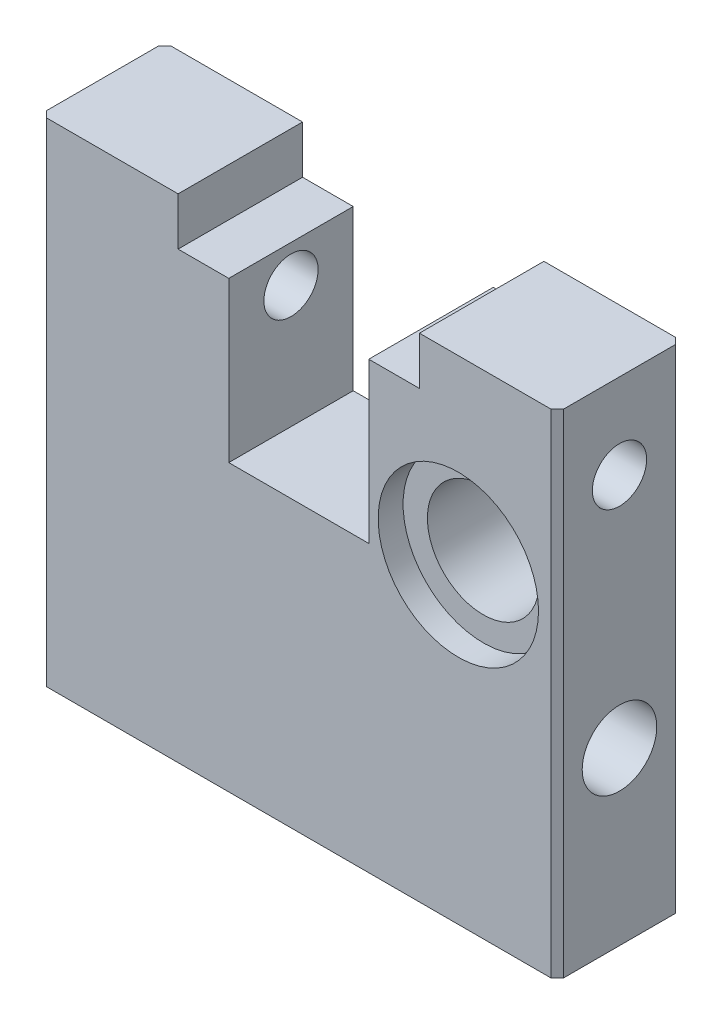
ISO-10303-21;
HEADER;
FILE_DESCRIPTION(('STEP AP214'),'2;1');
FILE_NAME('part.step','',(''),(''),'','','');
FILE_SCHEMA(('AUTOMOTIVE_DESIGN { 1 0 10303 214 1 1 1 1 }'));
ENDSEC;
DATA;
#1=APPLICATION_CONTEXT('core data for automotive mechanical design processes');
#2=APPLICATION_PROTOCOL_DEFINITION('international standard','automotive_design',2000,#1);
#3=PRODUCT_CONTEXT('',#1,'mechanical');
#4=PRODUCT('Part','Part','',(#3));
#5=PRODUCT_RELATED_PRODUCT_CATEGORY('part','',(#4));
#6=PRODUCT_DEFINITION_FORMATION('','',#4);
#7=PRODUCT_DEFINITION_CONTEXT('part definition',#1,'design');
#8=PRODUCT_DEFINITION('design','',#6,#7);
#9=PRODUCT_DEFINITION_SHAPE('','',#8);
#10=(LENGTH_UNIT() NAMED_UNIT(*) SI_UNIT(.MILLI.,.METRE.));
#11=(NAMED_UNIT(*) PLANE_ANGLE_UNIT() SI_UNIT($,.RADIAN.));
#12=(NAMED_UNIT(*) SI_UNIT($,.STERADIAN.) SOLID_ANGLE_UNIT());
#13=UNCERTAINTY_MEASURE_WITH_UNIT(LENGTH_MEASURE(1.E-05),#10,'distance_accuracy_value','');
#14=(GEOMETRIC_REPRESENTATION_CONTEXT(3) GLOBAL_UNCERTAINTY_ASSIGNED_CONTEXT((#13)) GLOBAL_UNIT_ASSIGNED_CONTEXT((#10,
#11,#12)) REPRESENTATION_CONTEXT('',''));
#15=CARTESIAN_POINT('',(0.,0.,0.));
#16=DIRECTION('',(0.,0.,1.));
#17=DIRECTION('',(1.,0.,0.));
#18=AXIS2_PLACEMENT_3D('',#15,#16,#17);
#19=CARTESIAN_POINT('',(16.4592,25.9588,3.9624));
#20=DIRECTION('',(-1.,0.,0.));
#21=DIRECTION('',(0.,0.,1.));
#22=AXIS2_PLACEMENT_3D('',#19,#20,#21);
#23=CYLINDRICAL_SURFACE('',#22,1.7272);
#24=CARTESIAN_POINT('',(-4.4577,25.9588,3.9624));
#25=DIRECTION('',(-1.,0.,0.));
#26=DIRECTION('',(0.,-1.,0.));
#27=AXIS2_PLACEMENT_3D('',#24,#25,#26);
#28=CIRCLE('',#27,1.7272);
#29=CARTESIAN_POINT('',(-4.4577,24.2316,3.9624));
#30=VERTEX_POINT('',#29);
#31=EDGE_CURVE('E246',#30,#30,#28,.T.);
#32=ORIENTED_EDGE('',*,*,#31,.F.);
#33=EDGE_LOOP('',(#32));
#34=FACE_BOUND('',#33,.T.);
#35=CARTESIAN_POINT('',(-9.31545,25.9588,3.9624));
#36=DIRECTION('',(-1.,0.,0.));
#37=DIRECTION('',(0.,0.,1.));
#38=AXIS2_PLACEMENT_3D('',#35,#36,#37);
#39=CIRCLE('',#38,1.7272);
#40=CARTESIAN_POINT('',(-9.31545,25.9588,5.6896));
#41=VERTEX_POINT('',#40);
#42=EDGE_CURVE('E251',#41,#41,#39,.F.);
#43=ORIENTED_EDGE('',*,*,#42,.F.);
#44=EDGE_LOOP('',(#43));
#45=FACE_BOUND('',#44,.T.);
#46=ADVANCED_FACE('F35',(#34,#45),#23,.F.);
#47=CARTESIAN_POINT('',(10.16,19.83994,7.9248));
#48=DIRECTION('',(0.,0.,-1.));
#49=DIRECTION('',(-1.,0.,0.));
#50=AXIS2_PLACEMENT_3D('',#47,#48,#49);
#51=CYLINDRICAL_SURFACE('',#50,3.556);
#52=CARTESIAN_POINT('',(10.16,19.83994,0.));
#53=DIRECTION('',(0.,0.,1.));
#54=DIRECTION('',(1.,0.,0.));
#55=AXIS2_PLACEMENT_3D('',#52,#53,#54);
#56=CIRCLE('',#55,3.556);
#57=CARTESIAN_POINT('',(13.716,19.83994,0.));
#58=VERTEX_POINT('',#57);
#59=EDGE_CURVE('E196',#58,#58,#56,.T.);
#60=ORIENTED_EDGE('',*,*,#59,.F.);
#61=EDGE_LOOP('',(#60));
#62=FACE_BOUND('',#61,.T.);
#63=CARTESIAN_POINT('',(10.16,19.83994,6.3373));
#64=DIRECTION('',(0.,0.,1.));
#65=DIRECTION('',(1.,0.,0.));
#66=AXIS2_PLACEMENT_3D('',#63,#64,#65);
#67=CIRCLE('',#66,3.556);
#68=CARTESIAN_POINT('',(13.716,19.83994,6.3373));
#69=VERTEX_POINT('',#68);
#70=EDGE_CURVE('E242',#69,#69,#67,.T.);
#71=ORIENTED_EDGE('',*,*,#70,.T.);
#72=EDGE_LOOP('',(#71));
#73=FACE_BOUND('',#72,.T.);
#74=ADVANCED_FACE('F368',(#62,#73),#51,.F.);
#75=CARTESIAN_POINT('',(0.,0.,7.9248));
#76=DIRECTION('',(0.,0.,-1.));
#77=DIRECTION('',(-1.,0.,0.));
#78=AXIS2_PLACEMENT_3D('',#75,#76,#77);
#79=PLANE('',#78);
#80=CARTESIAN_POINT('',(10.16,19.83994,7.9248));
#81=DIRECTION('',(0.,0.,1.));
#82=DIRECTION('',(1.,0.,0.));
#83=AXIS2_PLACEMENT_3D('',#80,#81,#82);
#84=CIRCLE('',#83,5.1054);
#85=CARTESIAN_POINT('',(15.2654,19.83994,7.9248));
#86=VERTEX_POINT('',#85);
#87=EDGE_CURVE('E319',#86,#86,#84,.T.);
#88=ORIENTED_EDGE('',*,*,#87,.F.);
#89=EDGE_LOOP('',(#88));
#90=FACE_BOUND('',#89,.T.);
#91=DIRECTION('',(1.,0.,0.));
#92=VECTOR('',#91,1.);
#93=CARTESIAN_POINT('',(-16.4592,0.,7.9248));
#94=LINE('',#93,#92);
#95=CARTESIAN_POINT('',(-16.062325,0.,7.9248));
#96=VERTEX_POINT('',#95);
#97=CARTESIAN_POINT('',(16.062325,0.,7.9248));
#98=VERTEX_POINT('',#97);
#99=EDGE_CURVE('E158',#96,#98,#94,.T.);
#100=ORIENTED_EDGE('',*,*,#99,.T.);
#101=DIRECTION('',(0.,1.,0.));
#102=VECTOR('',#101,1.);
#103=CARTESIAN_POINT('',(16.062325,0.,7.9248));
#104=LINE('',#103,#102);
#105=CARTESIAN_POINT('',(16.062325,31.369,7.9248));
#106=VERTEX_POINT('',#105);
#107=EDGE_CURVE('E156',#98,#106,#104,.T.);
#108=ORIENTED_EDGE('',*,*,#107,.T.);
#109=DIRECTION('',(-1.,0.,0.));
#110=VECTOR('',#109,1.);
#111=CARTESIAN_POINT('',(7.6835,31.369,7.9248));
#112=LINE('',#111,#110);
#113=CARTESIAN_POINT('',(7.6835,31.369,7.9248));
#114=VERTEX_POINT('',#113);
#115=EDGE_CURVE('E148',#106,#114,#112,.T.);
#116=ORIENTED_EDGE('',*,*,#115,.T.);
#117=DIRECTION('',(0.,-1.,0.));
#118=VECTOR('',#117,1.);
#119=CARTESIAN_POINT('',(7.6835,31.369,7.9248));
#120=LINE('',#119,#118);
#121=CARTESIAN_POINT('',(7.6835,28.321,7.9248));
#122=VERTEX_POINT('',#121);
#123=EDGE_CURVE('E153',#114,#122,#120,.T.);
#124=ORIENTED_EDGE('',*,*,#123,.T.);
#125=DIRECTION('',(-1.,0.,0.));
#126=VECTOR('',#125,1.);
#127=CARTESIAN_POINT('',(7.6835,28.321,7.9248));
#128=LINE('',#127,#126);
#129=CARTESIAN_POINT('',(4.4577,28.321,7.9248));
#130=VERTEX_POINT('',#129);
#131=EDGE_CURVE('E174',#122,#130,#128,.T.);
#132=ORIENTED_EDGE('',*,*,#131,.T.);
#133=DIRECTION('',(0.,-1.,0.));
#134=VECTOR('',#133,1.);
#135=CARTESIAN_POINT('',(4.4577,28.321,7.9248));
#136=LINE('',#135,#134);
#137=CARTESIAN_POINT('',(4.4577,18.161,7.9248));
#138=VERTEX_POINT('',#137);
#139=EDGE_CURVE('E176',#130,#138,#136,.T.);
#140=ORIENTED_EDGE('',*,*,#139,.T.);
#141=DIRECTION('',(-1.,0.,0.));
#142=VECTOR('',#141,1.);
#143=CARTESIAN_POINT('',(4.4577,18.161,7.9248));
#144=LINE('',#143,#142);
#145=CARTESIAN_POINT('',(-4.4577,18.161,7.9248));
#146=VERTEX_POINT('',#145);
#147=EDGE_CURVE('E181',#138,#146,#144,.T.);
#148=ORIENTED_EDGE('',*,*,#147,.T.);
#149=DIRECTION('',(0.,1.,0.));
#150=VECTOR('',#149,1.);
#151=CARTESIAN_POINT('',(-4.4577,28.321,7.9248));
#152=LINE('',#151,#150);
#153=CARTESIAN_POINT('',(-4.4577,28.321,7.9248));
#154=VERTEX_POINT('',#153);
#155=EDGE_CURVE('E183',#146,#154,#152,.T.);
#156=ORIENTED_EDGE('',*,*,#155,.T.);
#157=DIRECTION('',(-1.,0.,0.));
#158=VECTOR('',#157,1.);
#159=CARTESIAN_POINT('',(-4.4577,28.321,7.9248));
#160=LINE('',#159,#158);
#161=CARTESIAN_POINT('',(-7.6835,28.321,7.9248));
#162=VERTEX_POINT('',#161);
#163=EDGE_CURVE('E185',#154,#162,#160,.T.);
#164=ORIENTED_EDGE('',*,*,#163,.T.);
#165=DIRECTION('',(0.,1.,0.));
#166=VECTOR('',#165,1.);
#167=CARTESIAN_POINT('',(-7.6835,31.369,7.9248));
#168=LINE('',#167,#166);
#169=CARTESIAN_POINT('',(-7.6835,31.369,7.9248));
#170=VERTEX_POINT('',#169);
#171=EDGE_CURVE('E187',#162,#170,#168,.T.);
#172=ORIENTED_EDGE('',*,*,#171,.T.);
#173=DIRECTION('',(-1.,0.,0.));
#174=VECTOR('',#173,1.);
#175=CARTESIAN_POINT('',(-16.4592,31.369,7.9248));
#176=LINE('',#175,#174);
#177=CARTESIAN_POINT('',(-16.062325,31.369,7.9248));
#178=VERTEX_POINT('',#177);
#179=EDGE_CURVE('E189',#170,#178,#176,.T.);
#180=ORIENTED_EDGE('',*,*,#179,.T.);
#181=DIRECTION('',(0.,-1.,0.));
#182=VECTOR('',#181,1.);
#183=CARTESIAN_POINT('',(-16.062325,0.,7.9248));
#184=LINE('',#183,#182);
#185=EDGE_CURVE('E276',#178,#96,#184,.T.);
#186=ORIENTED_EDGE('',*,*,#185,.T.);
#187=EDGE_LOOP('',(#100,#108,#116,#124,#132,#140,#148,#156,#164,#172,#180,#186));
#188=FACE_BOUND('',#187,.T.);
#189=ADVANCED_FACE('F151',(#90,#188),#79,.F.);
#190=CARTESIAN_POINT('',(0.,0.,0.));
#191=DIRECTION('',(0.,0.,-1.));
#192=DIRECTION('',(-1.,0.,0.));
#193=AXIS2_PLACEMENT_3D('',#190,#191,#192);
#194=PLANE('',#193);
#195=DIRECTION('',(-1.,0.,0.));
#196=VECTOR('',#195,1.);
#197=CARTESIAN_POINT('',(7.6835,31.369,0.));
#198=LINE('',#197,#196);
#199=CARTESIAN_POINT('',(16.062325,31.369,0.));
#200=VERTEX_POINT('',#199);
#201=CARTESIAN_POINT('',(7.6835,31.369,0.));
#202=VERTEX_POINT('',#201);
#203=EDGE_CURVE('E165',#200,#202,#198,.T.);
#204=ORIENTED_EDGE('',*,*,#203,.F.);
#205=DIRECTION('',(0.,-1.,0.));
#206=VECTOR('',#205,1.);
#207=CARTESIAN_POINT('',(16.062325,0.,0.));
#208=LINE('',#207,#206);
#209=CARTESIAN_POINT('',(16.062325,0.,0.));
#210=VERTEX_POINT('',#209);
#211=EDGE_CURVE('E266',#200,#210,#208,.T.);
#212=ORIENTED_EDGE('',*,*,#211,.T.);
#213=DIRECTION('',(1.,0.,0.));
#214=VECTOR('',#213,1.);
#215=CARTESIAN_POINT('',(-16.4592,0.,0.));
#216=LINE('',#215,#214);
#217=CARTESIAN_POINT('',(-16.062325,0.,0.));
#218=VERTEX_POINT('',#217);
#219=EDGE_CURVE('E193',#218,#210,#216,.T.);
#220=ORIENTED_EDGE('',*,*,#219,.F.);
#221=DIRECTION('',(0.,1.,0.));
#222=VECTOR('',#221,1.);
#223=CARTESIAN_POINT('',(-16.062325,31.369,0.));
#224=LINE('',#223,#222);
#225=CARTESIAN_POINT('',(-16.062325,31.369,0.));
#226=VERTEX_POINT('',#225);
#227=EDGE_CURVE('E264',#218,#226,#224,.T.);
#228=ORIENTED_EDGE('',*,*,#227,.T.);
#229=DIRECTION('',(-1.,0.,0.));
#230=VECTOR('',#229,1.);
#231=CARTESIAN_POINT('',(-16.4592,31.369,0.));
#232=LINE('',#231,#230);
#233=CARTESIAN_POINT('',(-7.6835,31.369,0.));
#234=VERTEX_POINT('',#233);
#235=EDGE_CURVE('E212',#234,#226,#232,.T.);
#236=ORIENTED_EDGE('',*,*,#235,.F.);
#237=DIRECTION('',(0.,1.,0.));
#238=VECTOR('',#237,1.);
#239=CARTESIAN_POINT('',(-7.6835,31.369,0.));
#240=LINE('',#239,#238);
#241=CARTESIAN_POINT('',(-7.6835,28.321,0.));
#242=VERTEX_POINT('',#241);
#243=EDGE_CURVE('E210',#242,#234,#240,.T.);
#244=ORIENTED_EDGE('',*,*,#243,.F.);
#245=DIRECTION('',(-1.,0.,0.));
#246=VECTOR('',#245,1.);
#247=CARTESIAN_POINT('',(-4.4577,28.321,0.));
#248=LINE('',#247,#246);
#249=CARTESIAN_POINT('',(-4.4577,28.321,0.));
#250=VERTEX_POINT('',#249);
#251=EDGE_CURVE('E208',#250,#242,#248,.T.);
#252=ORIENTED_EDGE('',*,*,#251,.F.);
#253=DIRECTION('',(0.,1.,0.));
#254=VECTOR('',#253,1.);
#255=CARTESIAN_POINT('',(-4.4577,28.321,0.));
#256=LINE('',#255,#254);
#257=CARTESIAN_POINT('',(-4.4577,18.161,0.));
#258=VERTEX_POINT('',#257);
#259=EDGE_CURVE('E206',#258,#250,#256,.T.);
#260=ORIENTED_EDGE('',*,*,#259,.F.);
#261=DIRECTION('',(-1.,0.,0.));
#262=VECTOR('',#261,1.);
#263=CARTESIAN_POINT('',(4.4577,18.161,0.));
#264=LINE('',#263,#262);
#265=CARTESIAN_POINT('',(4.4577,18.161,0.));
#266=VERTEX_POINT('',#265);
#267=EDGE_CURVE('E204',#266,#258,#264,.T.);
#268=ORIENTED_EDGE('',*,*,#267,.F.);
#269=DIRECTION('',(0.,-1.,0.));
#270=VECTOR('',#269,1.);
#271=CARTESIAN_POINT('',(4.4577,28.321,0.));
#272=LINE('',#271,#270);
#273=CARTESIAN_POINT('',(4.4577,28.321,0.));
#274=VERTEX_POINT('',#273);
#275=EDGE_CURVE('E202',#274,#266,#272,.T.);
#276=ORIENTED_EDGE('',*,*,#275,.F.);
#277=DIRECTION('',(-1.,0.,0.));
#278=VECTOR('',#277,1.);
#279=CARTESIAN_POINT('',(7.6835,28.321,0.));
#280=LINE('',#279,#278);
#281=CARTESIAN_POINT('',(7.6835,28.321,0.));
#282=VERTEX_POINT('',#281);
#283=EDGE_CURVE('E200',#282,#274,#280,.T.);
#284=ORIENTED_EDGE('',*,*,#283,.F.);
#285=DIRECTION('',(0.,-1.,0.));
#286=VECTOR('',#285,1.);
#287=CARTESIAN_POINT('',(7.6835,31.369,0.));
#288=LINE('',#287,#286);
#289=EDGE_CURVE('E198',#202,#282,#288,.T.);
#290=ORIENTED_EDGE('',*,*,#289,.F.);
#291=EDGE_LOOP('',(#204,#212,#220,#228,#236,#244,#252,#260,#268,#276,#284,#290));
#292=FACE_BOUND('',#291,.T.);
#293=ORIENTED_EDGE('',*,*,#59,.T.);
#294=EDGE_LOOP('',(#293));
#295=FACE_BOUND('',#294,.T.);
#296=ADVANCED_FACE('F301',(#292,#295),#194,.T.);
#297=CARTESIAN_POINT('',(-16.4592,0.,7.9248));
#298=DIRECTION('',(1.,0.,0.));
#299=DIRECTION('',(0.,0.,-1.));
#300=AXIS2_PLACEMENT_3D('',#297,#298,#299);
#301=PLANE('',#300);
#302=CARTESIAN_POINT('',(-16.4592,25.9588,3.9624));
#303=DIRECTION('',(-1.,0.,0.));
#304=DIRECTION('',(0.,0.,1.));
#305=AXIS2_PLACEMENT_3D('',#302,#303,#304);
#306=CIRCLE('',#305,3.2004);
#307=CARTESIAN_POINT('',(-16.4592,25.9588,7.1628));
#308=VERTEX_POINT('',#307);
#309=EDGE_CURVE('E333',#308,#308,#306,.T.);
#310=ORIENTED_EDGE('',*,*,#309,.F.);
#311=EDGE_LOOP('',(#310));
#312=FACE_BOUND('',#311,.T.);
#313=CARTESIAN_POINT('',(-16.4592,10.8966,3.9624));
#314=DIRECTION('',(-1.,0.,0.));
#315=DIRECTION('',(0.,0.,1.));
#316=AXIS2_PLACEMENT_3D('',#313,#314,#315);
#317=CIRCLE('',#316,2.3749);
#318=CARTESIAN_POINT('',(-16.4592,10.8966,6.3373));
#319=VERTEX_POINT('',#318);
#320=EDGE_CURVE('E254',#319,#319,#317,.T.);
#321=ORIENTED_EDGE('',*,*,#320,.F.);
#322=EDGE_LOOP('',(#321));
#323=FACE_BOUND('',#322,.T.);
#324=DIRECTION('',(0.,0.,-1.));
#325=VECTOR('',#324,1.);
#326=CARTESIAN_POINT('',(-16.4592,31.369,7.9248));
#327=LINE('',#326,#325);
#328=CARTESIAN_POINT('',(-16.4592,31.369,7.527925));
#329=VERTEX_POINT('',#328);
#330=CARTESIAN_POINT('',(-16.4592,31.369,0.396875));
#331=VERTEX_POINT('',#330);
#332=EDGE_CURVE('E192',#329,#331,#327,.T.);
#333=ORIENTED_EDGE('',*,*,#332,.T.);
#334=DIRECTION('',(0.,-1.,0.));
#335=VECTOR('',#334,1.);
#336=CARTESIAN_POINT('',(-16.4592,0.,0.396874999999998));
#337=LINE('',#336,#335);
#338=CARTESIAN_POINT('',(-16.4592,0.,0.396875));
#339=VERTEX_POINT('',#338);
#340=EDGE_CURVE('E281',#331,#339,#337,.T.);
#341=ORIENTED_EDGE('',*,*,#340,.T.);
#342=DIRECTION('',(0.,0.,-1.));
#343=VECTOR('',#342,1.);
#344=CARTESIAN_POINT('',(-16.4592,0.,7.9248));
#345=LINE('',#344,#343);
#346=CARTESIAN_POINT('',(-16.4592,0.,7.527925));
#347=VERTEX_POINT('',#346);
#348=EDGE_CURVE('E238',#347,#339,#345,.T.);
#349=ORIENTED_EDGE('',*,*,#348,.F.);
#350=DIRECTION('',(0.,1.,0.));
#351=VECTOR('',#350,1.);
#352=CARTESIAN_POINT('',(-16.4592,0.,7.527925));
#353=LINE('',#352,#351);
#354=EDGE_CURVE('E55',#347,#329,#353,.T.);
#355=ORIENTED_EDGE('',*,*,#354,.T.);
#356=EDGE_LOOP('',(#333,#341,#349,#355));
#357=FACE_BOUND('',#356,.T.);
#358=ADVANCED_FACE('F293',(#312,#323,#357),#301,.F.);
#359=CARTESIAN_POINT('',(-16.4592,0.,7.9248));
#360=DIRECTION('',(0.,1.,0.));
#361=DIRECTION('',(0.,0.,1.));
#362=AXIS2_PLACEMENT_3D('',#359,#360,#361);
#363=PLANE('',#362);
#364=ORIENTED_EDGE('',*,*,#219,.T.);
#365=DIRECTION('',(0.707106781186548,0.,0.707106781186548));
#366=VECTOR('',#365,1.);
#367=CARTESIAN_POINT('',(16.4592,0.,0.396874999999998));
#368=LINE('',#367,#366);
#369=CARTESIAN_POINT('',(16.4592,0.,0.396875));
#370=VERTEX_POINT('',#369);
#371=EDGE_CURVE('E274',#210,#370,#368,.T.);
#372=ORIENTED_EDGE('',*,*,#371,.T.);
#373=DIRECTION('',(0.,0.,-1.));
#374=VECTOR('',#373,1.);
#375=CARTESIAN_POINT('',(16.4592,0.,7.9248));
#376=LINE('',#375,#374);
#377=CARTESIAN_POINT('',(16.4592,0.,7.527925));
#378=VERTEX_POINT('',#377);
#379=EDGE_CURVE('E235',#378,#370,#376,.T.);
#380=ORIENTED_EDGE('',*,*,#379,.F.);
#381=DIRECTION('',(0.707106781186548,0.,-0.707106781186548));
#382=VECTOR('',#381,1.);
#383=CARTESIAN_POINT('',(16.062325,0.,7.9248));
#384=LINE('',#383,#382);
#385=EDGE_CURVE('E272',#378,#98,#384,.F.);
#386=ORIENTED_EDGE('',*,*,#385,.T.);
#387=ORIENTED_EDGE('',*,*,#99,.F.);
#388=DIRECTION('',(0.707106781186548,0.,0.707106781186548));
#389=VECTOR('',#388,1.);
#390=CARTESIAN_POINT('',(-16.062325,0.,7.9248));
#391=LINE('',#390,#389);
#392=EDGE_CURVE('E268',#96,#347,#391,.F.);
#393=ORIENTED_EDGE('',*,*,#392,.T.);
#394=ORIENTED_EDGE('',*,*,#348,.T.);
#395=DIRECTION('',(0.707106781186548,0.,-0.707106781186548));
#396=VECTOR('',#395,1.);
#397=CARTESIAN_POINT('',(-16.4592,0.,0.396874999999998));
#398=LINE('',#397,#396);
#399=EDGE_CURVE('E270',#339,#218,#398,.T.);
#400=ORIENTED_EDGE('',*,*,#399,.T.);
#401=EDGE_LOOP('',(#364,#372,#380,#386,#387,#393,#394,#400));
#402=FACE_BOUND('',#401,.T.);
#403=ADVANCED_FACE('F292',(#402),#363,.F.);
#404=CARTESIAN_POINT('',(16.4592,0.,7.9248));
#405=DIRECTION('',(-1.,0.,0.));
#406=DIRECTION('',(0.,0.,1.));
#407=AXIS2_PLACEMENT_3D('',#404,#405,#406);
#408=PLANE('',#407);
#409=CARTESIAN_POINT('',(16.4592,10.8966,3.9624));
#410=DIRECTION('',(-1.,0.,0.));
#411=DIRECTION('',(0.,0.,1.));
#412=AXIS2_PLACEMENT_3D('',#409,#410,#411);
#413=CIRCLE('',#412,2.3749);
#414=CARTESIAN_POINT('',(16.4592,10.8966,6.3373));
#415=VERTEX_POINT('',#414);
#416=EDGE_CURVE('E328',#415,#415,#413,.T.);
#417=ORIENTED_EDGE('',*,*,#416,.T.);
#418=EDGE_LOOP('',(#417));
#419=FACE_BOUND('',#418,.T.);
#420=CARTESIAN_POINT('',(16.4592,25.9588,3.9624));
#421=DIRECTION('',(-1.,0.,0.));
#422=DIRECTION('',(0.,0.,1.));
#423=AXIS2_PLACEMENT_3D('',#420,#421,#422);
#424=CIRCLE('',#423,1.7272);
#425=CARTESIAN_POINT('',(16.4592,25.9588,5.6896));
#426=VERTEX_POINT('',#425);
#427=EDGE_CURVE('E250',#426,#426,#424,.T.);
#428=ORIENTED_EDGE('',*,*,#427,.T.);
#429=EDGE_LOOP('',(#428));
#430=FACE_BOUND('',#429,.T.);
#431=ORIENTED_EDGE('',*,*,#379,.T.);
#432=DIRECTION('',(0.,1.,0.));
#433=VECTOR('',#432,1.);
#434=CARTESIAN_POINT('',(16.4592,31.369,0.396874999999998));
#435=LINE('',#434,#433);
#436=CARTESIAN_POINT('',(16.4592,31.369,0.396875));
#437=VERTEX_POINT('',#436);
#438=EDGE_CURVE('E257',#370,#437,#435,.T.);
#439=ORIENTED_EDGE('',*,*,#438,.T.);
#440=DIRECTION('',(0.,0.,-1.));
#441=VECTOR('',#440,1.);
#442=CARTESIAN_POINT('',(16.4592,31.369,7.9248));
#443=LINE('',#442,#441);
#444=CARTESIAN_POINT('',(16.4592,31.369,7.527925));
#445=VERTEX_POINT('',#444);
#446=EDGE_CURVE('E168',#445,#437,#443,.T.);
#447=ORIENTED_EDGE('',*,*,#446,.F.);
#448=DIRECTION('',(0.,-1.,0.));
#449=VECTOR('',#448,1.);
#450=CARTESIAN_POINT('',(16.4592,0.,7.527925));
#451=LINE('',#450,#449);
#452=EDGE_CURVE('E241',#445,#378,#451,.T.);
#453=ORIENTED_EDGE('',*,*,#452,.T.);
#454=EDGE_LOOP('',(#431,#439,#447,#453));
#455=FACE_BOUND('',#454,.T.);
#456=ADVANCED_FACE('F311',(#419,#430,#455),#408,.F.);
#457=CARTESIAN_POINT('',(7.6835,31.369,7.9248));
#458=DIRECTION('',(0.,-1.,0.));
#459=DIRECTION('',(0.,0.,-1.));
#460=AXIS2_PLACEMENT_3D('',#457,#458,#459);
#461=PLANE('',#460);
#462=ORIENTED_EDGE('',*,*,#446,.T.);
#463=DIRECTION('',(-0.707106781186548,0.,-0.707106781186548));
#464=VECTOR('',#463,1.);
#465=CARTESIAN_POINT('',(16.4592,31.369,0.396874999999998));
#466=LINE('',#465,#464);
#467=EDGE_CURVE('E262',#437,#200,#466,.T.);
#468=ORIENTED_EDGE('',*,*,#467,.T.);
#469=ORIENTED_EDGE('',*,*,#203,.T.);
#470=DIRECTION('',(0.,0.,-1.));
#471=VECTOR('',#470,1.);
#472=CARTESIAN_POINT('',(7.6835,31.369,7.9248));
#473=LINE('',#472,#471);
#474=EDGE_CURVE('E161',#114,#202,#473,.T.);
#475=ORIENTED_EDGE('',*,*,#474,.F.);
#476=ORIENTED_EDGE('',*,*,#115,.F.);
#477=DIRECTION('',(-0.707106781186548,0.,0.707106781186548));
#478=VECTOR('',#477,1.);
#479=CARTESIAN_POINT('',(16.062325,31.369,7.9248));
#480=LINE('',#479,#478);
#481=EDGE_CURVE('E260',#106,#445,#480,.F.);
#482=ORIENTED_EDGE('',*,*,#481,.T.);
#483=EDGE_LOOP('',(#462,#468,#469,#475,#476,#482));
#484=FACE_BOUND('',#483,.T.);
#485=ADVANCED_FACE('F163',(#484),#461,.F.);
#486=CARTESIAN_POINT('',(7.6835,31.369,7.9248));
#487=DIRECTION('',(1.,0.,0.));
#488=DIRECTION('',(0.,0.,-1.));
#489=AXIS2_PLACEMENT_3D('',#486,#487,#488);
#490=PLANE('',#489);
#491=ORIENTED_EDGE('',*,*,#289,.T.);
#492=DIRECTION('',(0.,0.,-1.));
#493=VECTOR('',#492,1.);
#494=CARTESIAN_POINT('',(7.6835,28.321,7.9248));
#495=LINE('',#494,#493);
#496=EDGE_CURVE('E169',#122,#282,#495,.T.);
#497=ORIENTED_EDGE('',*,*,#496,.F.);
#498=ORIENTED_EDGE('',*,*,#123,.F.);
#499=ORIENTED_EDGE('',*,*,#474,.T.);
#500=EDGE_LOOP('',(#491,#497,#498,#499));
#501=FACE_BOUND('',#500,.T.);
#502=ADVANCED_FACE('F171',(#501),#490,.F.);
#503=CARTESIAN_POINT('',(7.6835,28.321,7.9248));
#504=DIRECTION('',(0.,-1.,0.));
#505=DIRECTION('',(1.,0.,0.));
#506=AXIS2_PLACEMENT_3D('',#503,#504,#505);
#507=PLANE('',#506);
#508=ORIENTED_EDGE('',*,*,#283,.T.);
#509=DIRECTION('',(0.,0.,-1.));
#510=VECTOR('',#509,1.);
#511=CARTESIAN_POINT('',(4.4577,28.321,7.9248));
#512=LINE('',#511,#510);
#513=EDGE_CURVE('E230',#130,#274,#512,.T.);
#514=ORIENTED_EDGE('',*,*,#513,.F.);
#515=ORIENTED_EDGE('',*,*,#131,.F.);
#516=ORIENTED_EDGE('',*,*,#496,.T.);
#517=EDGE_LOOP('',(#508,#514,#515,#516));
#518=FACE_BOUND('',#517,.T.);
#519=ADVANCED_FACE('F411',(#518),#507,.F.);
#520=CARTESIAN_POINT('',(4.4577,28.321,7.9248));
#521=DIRECTION('',(1.,0.,0.));
#522=DIRECTION('',(0.,1.,0.));
#523=AXIS2_PLACEMENT_3D('',#520,#521,#522);
#524=PLANE('',#523);
#525=CARTESIAN_POINT('',(4.4577,25.9588,3.9624));
#526=DIRECTION('',(1.,0.,0.));
#527=DIRECTION('',(0.,1.,0.));
#528=AXIS2_PLACEMENT_3D('',#525,#526,#527);
#529=CIRCLE('',#528,1.7272);
#530=CARTESIAN_POINT('',(4.4577,27.686,3.9624));
#531=VERTEX_POINT('',#530);
#532=EDGE_CURVE('E249',#531,#531,#529,.T.);
#533=ORIENTED_EDGE('',*,*,#532,.T.);
#534=EDGE_LOOP('',(#533));
#535=FACE_BOUND('',#534,.T.);
#536=ORIENTED_EDGE('',*,*,#275,.T.);
#537=DIRECTION('',(0.,0.,-1.));
#538=VECTOR('',#537,1.);
#539=CARTESIAN_POINT('',(4.4577,18.161,7.9248));
#540=LINE('',#539,#538);
#541=EDGE_CURVE('E227',#138,#266,#540,.T.);
#542=ORIENTED_EDGE('',*,*,#541,.F.);
#543=ORIENTED_EDGE('',*,*,#139,.F.);
#544=ORIENTED_EDGE('',*,*,#513,.T.);
#545=EDGE_LOOP('',(#536,#542,#543,#544));
#546=FACE_BOUND('',#545,.T.);
#547=ADVANCED_FACE('F407',(#535,#546),#524,.F.);
#548=CARTESIAN_POINT('',(4.4577,18.161,7.9248));
#549=DIRECTION('',(0.,-1.,0.));
#550=DIRECTION('',(0.,0.,-1.));
#551=AXIS2_PLACEMENT_3D('',#548,#549,#550);
#552=PLANE('',#551);
#553=ORIENTED_EDGE('',*,*,#267,.T.);
#554=DIRECTION('',(0.,0.,-1.));
#555=VECTOR('',#554,1.);
#556=CARTESIAN_POINT('',(-4.4577,18.161,7.9248));
#557=LINE('',#556,#555);
#558=EDGE_CURVE('E224',#146,#258,#557,.T.);
#559=ORIENTED_EDGE('',*,*,#558,.F.);
#560=ORIENTED_EDGE('',*,*,#147,.F.);
#561=ORIENTED_EDGE('',*,*,#541,.T.);
#562=EDGE_LOOP('',(#553,#559,#560,#561));
#563=FACE_BOUND('',#562,.T.);
#564=ADVANCED_FACE('F403',(#563),#552,.F.);
#565=CARTESIAN_POINT('',(-4.4577,28.321,7.9248));
#566=DIRECTION('',(-1.,0.,0.));
#567=DIRECTION('',(0.,-1.,0.));
#568=AXIS2_PLACEMENT_3D('',#565,#566,#567);
#569=PLANE('',#568);
#570=ORIENTED_EDGE('',*,*,#31,.T.);
#571=EDGE_LOOP('',(#570));
#572=FACE_BOUND('',#571,.T.);
#573=ORIENTED_EDGE('',*,*,#259,.T.);
#574=DIRECTION('',(0.,0.,-1.));
#575=VECTOR('',#574,1.);
#576=CARTESIAN_POINT('',(-4.4577,28.321,7.9248));
#577=LINE('',#576,#575);
#578=EDGE_CURVE('E221',#154,#250,#577,.T.);
#579=ORIENTED_EDGE('',*,*,#578,.F.);
#580=ORIENTED_EDGE('',*,*,#155,.F.);
#581=ORIENTED_EDGE('',*,*,#558,.T.);
#582=EDGE_LOOP('',(#573,#579,#580,#581));
#583=FACE_BOUND('',#582,.T.);
#584=ADVANCED_FACE('F399',(#572,#583),#569,.F.);
#585=CARTESIAN_POINT('',(-4.4577,28.321,7.9248));
#586=DIRECTION('',(0.,-1.,0.));
#587=DIRECTION('',(1.,0.,0.));
#588=AXIS2_PLACEMENT_3D('',#585,#586,#587);
#589=PLANE('',#588);
#590=ORIENTED_EDGE('',*,*,#251,.T.);
#591=DIRECTION('',(0.,0.,-1.));
#592=VECTOR('',#591,1.);
#593=CARTESIAN_POINT('',(-7.6835,28.321,7.9248));
#594=LINE('',#593,#592);
#595=EDGE_CURVE('E218',#162,#242,#594,.T.);
#596=ORIENTED_EDGE('',*,*,#595,.F.);
#597=ORIENTED_EDGE('',*,*,#163,.F.);
#598=ORIENTED_EDGE('',*,*,#578,.T.);
#599=EDGE_LOOP('',(#590,#596,#597,#598));
#600=FACE_BOUND('',#599,.T.);
#601=ADVANCED_FACE('F395',(#600),#589,.F.);
#602=CARTESIAN_POINT('',(-7.6835,31.369,7.9248));
#603=DIRECTION('',(-1.,0.,0.));
#604=DIRECTION('',(0.,0.,1.));
#605=AXIS2_PLACEMENT_3D('',#602,#603,#604);
#606=PLANE('',#605);
#607=ORIENTED_EDGE('',*,*,#243,.T.);
#608=DIRECTION('',(0.,0.,-1.));
#609=VECTOR('',#608,1.);
#610=CARTESIAN_POINT('',(-7.6835,31.369,7.9248));
#611=LINE('',#610,#609);
#612=EDGE_CURVE('E215',#170,#234,#611,.T.);
#613=ORIENTED_EDGE('',*,*,#612,.F.);
#614=ORIENTED_EDGE('',*,*,#171,.F.);
#615=ORIENTED_EDGE('',*,*,#595,.T.);
#616=EDGE_LOOP('',(#607,#613,#614,#615));
#617=FACE_BOUND('',#616,.T.);
#618=ADVANCED_FACE('F392',(#617),#606,.F.);
#619=CARTESIAN_POINT('',(-16.4592,31.369,7.9248));
#620=DIRECTION('',(0.,-1.,0.));
#621=DIRECTION('',(0.,0.,-1.));
#622=AXIS2_PLACEMENT_3D('',#619,#620,#621);
#623=PLANE('',#622);
#624=ORIENTED_EDGE('',*,*,#235,.T.);
#625=DIRECTION('',(-0.707106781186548,0.,0.707106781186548));
#626=VECTOR('',#625,1.);
#627=CARTESIAN_POINT('',(-16.4592,31.369,0.396874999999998));
#628=LINE('',#627,#626);
#629=EDGE_CURVE('E11',#226,#331,#628,.T.);
#630=ORIENTED_EDGE('',*,*,#629,.T.);
#631=ORIENTED_EDGE('',*,*,#332,.F.);
#632=DIRECTION('',(-0.707106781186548,0.,-0.707106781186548));
#633=VECTOR('',#632,1.);
#634=CARTESIAN_POINT('',(-16.062325,31.369,7.9248));
#635=LINE('',#634,#633);
#636=EDGE_CURVE('E43',#329,#178,#635,.F.);
#637=ORIENTED_EDGE('',*,*,#636,.T.);
#638=ORIENTED_EDGE('',*,*,#179,.F.);
#639=ORIENTED_EDGE('',*,*,#612,.T.);
#640=EDGE_LOOP('',(#624,#630,#631,#637,#638,#639));
#641=FACE_BOUND('',#640,.T.);
#642=ADVANCED_FACE('F285',(#641),#623,.F.);
#643=CARTESIAN_POINT('',(10.16,19.83994,6.3373));
#644=DIRECTION('',(0.,0.,1.));
#645=DIRECTION('',(1.,0.,0.));
#646=AXIS2_PLACEMENT_3D('',#643,#644,#645);
#647=CYLINDRICAL_SURFACE('',#646,5.1054);
#648=CARTESIAN_POINT('',(10.16,19.83994,6.3373));
#649=DIRECTION('',(0.,0.,1.));
#650=DIRECTION('',(1.,0.,0.));
#651=AXIS2_PLACEMENT_3D('',#648,#649,#650);
#652=CIRCLE('',#651,5.1054);
#653=CARTESIAN_POINT('',(15.2654,19.83994,6.3373));
#654=VERTEX_POINT('',#653);
#655=EDGE_CURVE('E245',#654,#654,#652,.T.);
#656=ORIENTED_EDGE('',*,*,#655,.F.);
#657=EDGE_LOOP('',(#656));
#658=FACE_BOUND('',#657,.T.);
#659=ORIENTED_EDGE('',*,*,#87,.T.);
#660=EDGE_LOOP('',(#659));
#661=FACE_BOUND('',#660,.T.);
#662=ADVANCED_FACE('F380',(#658,#661),#647,.F.);
#663=CARTESIAN_POINT('',(10.16,19.83994,6.3373));
#664=DIRECTION('',(0.,0.,1.));
#665=DIRECTION('',(1.,0.,0.));
#666=AXIS2_PLACEMENT_3D('',#663,#664,#665);
#667=PLANE('',#666);
#668=ORIENTED_EDGE('',*,*,#70,.F.);
#669=EDGE_LOOP('',(#668));
#670=FACE_BOUND('',#669,.T.);
#671=ORIENTED_EDGE('',*,*,#655,.T.);
#672=EDGE_LOOP('',(#671));
#673=FACE_BOUND('',#672,.T.);
#674=ADVANCED_FACE('F363',(#670,#673),#667,.T.);
#675=ORIENTED_EDGE('',*,*,#427,.F.);
#676=EDGE_LOOP('',(#675));
#677=FACE_BOUND('',#676,.T.);
#678=ORIENTED_EDGE('',*,*,#532,.F.);
#679=EDGE_LOOP('',(#678));
#680=FACE_BOUND('',#679,.T.);
#681=ADVANCED_FACE('F355',(#677,#680),#23,.F.);
#682=CARTESIAN_POINT('',(16.4592,10.8966,3.9624));
#683=DIRECTION('',(-1.,0.,0.));
#684=DIRECTION('',(0.,0.,1.));
#685=AXIS2_PLACEMENT_3D('',#682,#683,#684);
#686=CYLINDRICAL_SURFACE('',#685,2.3749);
#687=ORIENTED_EDGE('',*,*,#416,.F.);
#688=EDGE_LOOP('',(#687));
#689=FACE_BOUND('',#688,.T.);
#690=ORIENTED_EDGE('',*,*,#320,.T.);
#691=EDGE_LOOP('',(#690));
#692=FACE_BOUND('',#691,.T.);
#693=ADVANCED_FACE('F353',(#689,#692),#686,.F.);
#694=CARTESIAN_POINT('',(-9.31545,25.9588,3.9624));
#695=DIRECTION('',(-1.,0.,0.));
#696=DIRECTION('',(0.,0.,1.));
#697=AXIS2_PLACEMENT_3D('',#694,#695,#696);
#698=PLANE('',#697);
#699=CARTESIAN_POINT('',(-9.31545,25.9588,3.9624));
#700=DIRECTION('',(-1.,0.,0.));
#701=DIRECTION('',(0.,0.,1.));
#702=AXIS2_PLACEMENT_3D('',#699,#700,#701);
#703=CIRCLE('',#702,3.2004);
#704=CARTESIAN_POINT('',(-9.31545,25.9588,7.1628));
#705=VERTEX_POINT('',#704);
#706=EDGE_CURVE('E255',#705,#705,#703,.T.);
#707=ORIENTED_EDGE('',*,*,#706,.T.);
#708=EDGE_LOOP('',(#707));
#709=FACE_BOUND('',#708,.T.);
#710=ORIENTED_EDGE('',*,*,#42,.T.);
#711=EDGE_LOOP('',(#710));
#712=FACE_BOUND('',#711,.T.);
#713=ADVANCED_FACE('F339',(#709,#712),#698,.T.);
#714=CARTESIAN_POINT('',(-9.31545,25.9588,3.9624));
#715=DIRECTION('',(-1.,0.,0.));
#716=DIRECTION('',(0.,0.,1.));
#717=AXIS2_PLACEMENT_3D('',#714,#715,#716);
#718=CYLINDRICAL_SURFACE('',#717,3.2004);
#719=ORIENTED_EDGE('',*,*,#706,.F.);
#720=EDGE_LOOP('',(#719));
#721=FACE_BOUND('',#720,.T.);
#722=ORIENTED_EDGE('',*,*,#309,.T.);
#723=EDGE_LOOP('',(#722));
#724=FACE_BOUND('',#723,.T.);
#725=ADVANCED_FACE('F342',(#721,#724),#718,.F.);
#726=CARTESIAN_POINT('',(16.4592,0.,0.396874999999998));
#727=DIRECTION('',(0.707106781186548,0.,-0.707106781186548));
#728=DIRECTION('',(0.,-1.,0.));
#729=AXIS2_PLACEMENT_3D('',#726,#727,#728);
#730=PLANE('',#729);
#731=ORIENTED_EDGE('',*,*,#371,.F.);
#732=ORIENTED_EDGE('',*,*,#211,.F.);
#733=ORIENTED_EDGE('',*,*,#467,.F.);
#734=ORIENTED_EDGE('',*,*,#438,.F.);
#735=EDGE_LOOP('',(#731,#732,#733,#734));
#736=FACE_BOUND('',#735,.T.);
#737=ADVANCED_FACE('F306',(#736),#730,.T.);
#738=CARTESIAN_POINT('',(16.062325,0.,7.9248));
#739=DIRECTION('',(-0.707106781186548,0.,-0.707106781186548));
#740=DIRECTION('',(0.,1.,0.));
#741=AXIS2_PLACEMENT_3D('',#738,#739,#740);
#742=PLANE('',#741);
#743=ORIENTED_EDGE('',*,*,#385,.F.);
#744=ORIENTED_EDGE('',*,*,#452,.F.);
#745=ORIENTED_EDGE('',*,*,#481,.F.);
#746=ORIENTED_EDGE('',*,*,#107,.F.);
#747=EDGE_LOOP('',(#743,#744,#745,#746));
#748=FACE_BOUND('',#747,.T.);
#749=ADVANCED_FACE('F315',(#748),#742,.F.);
#750=CARTESIAN_POINT('',(-16.4592,0.,0.396874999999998));
#751=DIRECTION('',(-0.707106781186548,0.,-0.707106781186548));
#752=DIRECTION('',(0.,1.,0.));
#753=AXIS2_PLACEMENT_3D('',#750,#751,#752);
#754=PLANE('',#753);
#755=ORIENTED_EDGE('',*,*,#629,.F.);
#756=ORIENTED_EDGE('',*,*,#227,.F.);
#757=ORIENTED_EDGE('',*,*,#399,.F.);
#758=ORIENTED_EDGE('',*,*,#340,.F.);
#759=EDGE_LOOP('',(#755,#756,#757,#758));
#760=FACE_BOUND('',#759,.T.);
#761=ADVANCED_FACE('F296',(#760),#754,.T.);
#762=CARTESIAN_POINT('',(-16.062325,0.,7.9248));
#763=DIRECTION('',(0.707106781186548,0.,-0.707106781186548));
#764=DIRECTION('',(0.,-1.,0.));
#765=AXIS2_PLACEMENT_3D('',#762,#763,#764);
#766=PLANE('',#765);
#767=ORIENTED_EDGE('',*,*,#636,.F.);
#768=ORIENTED_EDGE('',*,*,#354,.F.);
#769=ORIENTED_EDGE('',*,*,#392,.F.);
#770=ORIENTED_EDGE('',*,*,#185,.F.);
#771=EDGE_LOOP('',(#767,#768,#769,#770));
#772=FACE_BOUND('',#771,.T.);
#773=ADVANCED_FACE('F37',(#772),#766,.F.);
#774=CLOSED_SHELL('',(#46,#74,#189,#296,#358,#403,#456,#485,#502,#519,#547,#564,#584,#601,#618,
#642,#662,#674,#681,#693,#713,#725,#737,#749,#761,#773));
#775=MANIFOLD_SOLID_BREP('B2',#774);
#776=ADVANCED_BREP_SHAPE_REPRESENTATION('',(#18,#775),#14);
#777=SHAPE_DEFINITION_REPRESENTATION(#9,#776);
ENDSEC;
END-ISO-10303-21;
